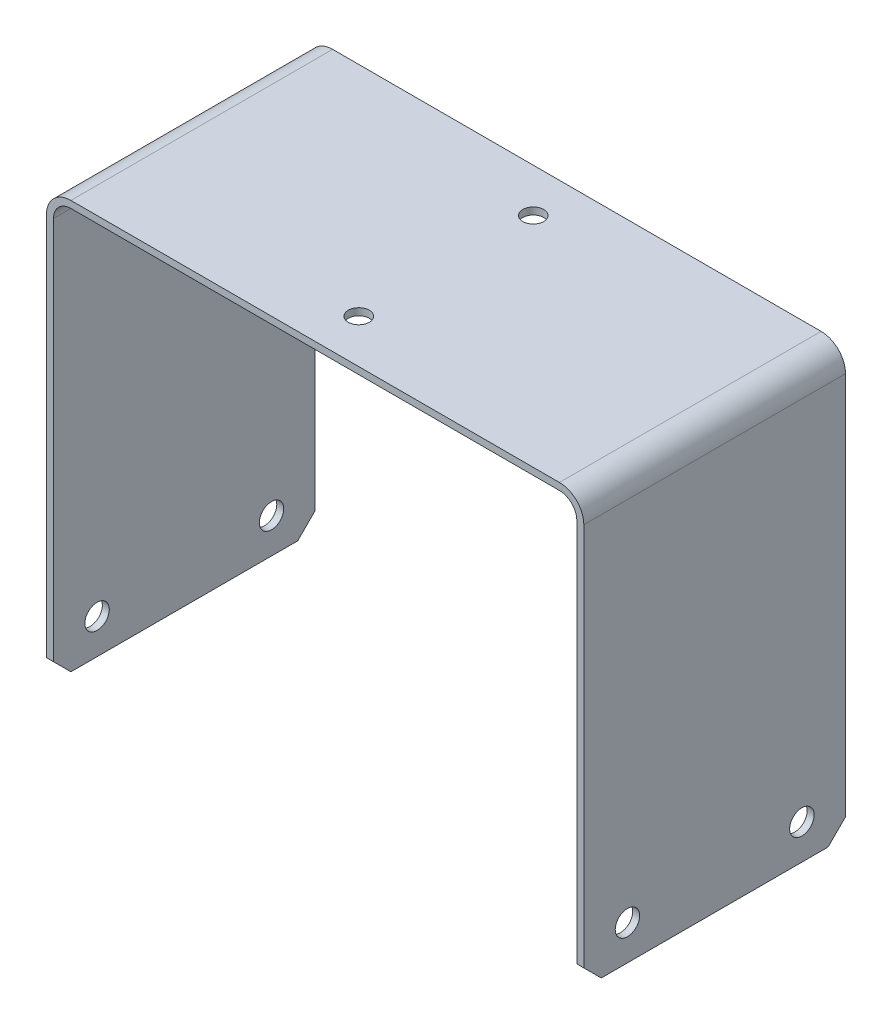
from build123d import *

# Parameters (mm, degrees)
EXTRU_MINCE1_DEPTH      = 37.5
ESQUISSE2_R             = 3
ENL_V_MAT_EXTRU_1_DEPTH = 75
CHANFREIN1_SIZE         = 5
ESQUISSE3_R             = 3.5
ENL_V_MAT_EXTRU_2_DEPTH = 189.484084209


with BuildPart() as part:
    # Esquisse1 → Extru.-Mince1 (new, symmetric)
    with BuildSketch(Plane.XY):
        with BuildLine():
            Line((-75, -20), (-75, 95))
            ThreePointArc((-75, 95), (-73.535533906, 98.535533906), (-70, 100))
            Line((-70, 100), (70, 100))
            ThreePointArc((70, 100), (73.535533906, 98.535533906), (75, 95))
            Line((75, 95), (75, -20))
            Line((75, -20), (77, -20))
            Line((77, -20), (77, 95))
            ThreePointArc((77, 95), (74.949747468, 99.949747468), (70, 102))
            Line((70, 102), (-70, 102))
            ThreePointArc((-70, 102), (-74.949747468, 99.949747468), (-77, 95))
            Line((-77, 95), (-77, -20))
            Line((-77, -20), (-75, -20))
        make_face()
    extrude(amount=EXTRU_MINCE1_DEPTH, both=True)

    # Esquisse2 → Enl_v. mat.-Extru.1 (cut)
    with BuildSketch(Plane(origin=(0, 102, 0), x_dir=(-1, 0, 0), z_dir=(0, 1, 0))):
        with Locations(Location((0, 25, 0), (0, 0, 90))):
            Circle(ESQUISSE2_R)
        with Locations(Location((0, -25, 0), (0, 0, 90))):
            Circle(ESQUISSE2_R)
    extrude(amount=-ENL_V_MAT_EXTRU_1_DEPTH, mode=Mode.SUBTRACT)

    # Chanfrein1
    chanfrein1_edges = [part.edges().sort_by_distance(p)[0] for p in [
        (76, -20, -37.5),
        (-76, -20, 37.5),
        (76, -20, 37.5),
        (-76, -20, -37.5),
    ]]
    chamfer(chanfrein1_edges, length=CHANFREIN1_SIZE)

    # Esquisse3 → Enl_v. mat.-Extru.2 (cut, through all)
    with BuildSketch(Plane.ZY.offset(77)):
        with Locations(Location((25, -10, 0), (0, 0, 270))):
            Circle(ESQUISSE3_R)
        with Locations(Location((-25, -10, 0), (0, 0, 270))):
            Circle(ESQUISSE3_R)
    extrude(amount=-ENL_V_MAT_EXTRU_2_DEPTH, mode=Mode.SUBTRACT)


solid = part.part
